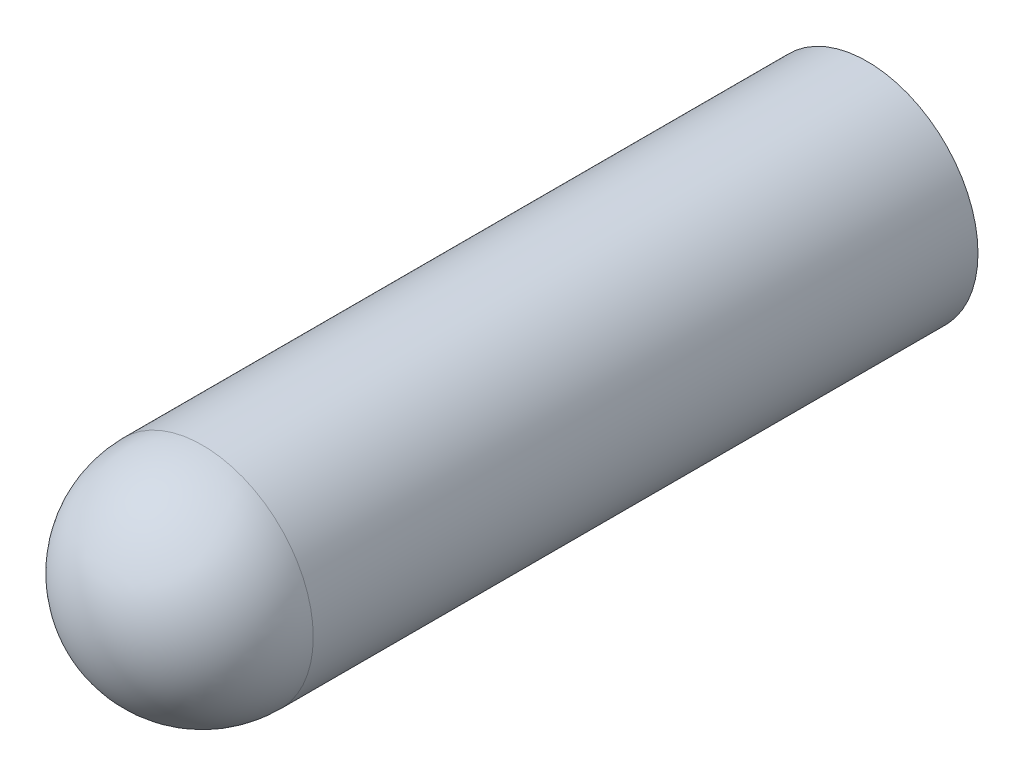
ISO-10303-21;
HEADER;
FILE_DESCRIPTION(('STEP AP214'),'2;1');
FILE_NAME('part.step','',(''),(''),'','','');
FILE_SCHEMA(('AUTOMOTIVE_DESIGN { 1 0 10303 214 1 1 1 1 }'));
ENDSEC;
DATA;
#1=APPLICATION_CONTEXT('core data for automotive mechanical design processes');
#2=APPLICATION_PROTOCOL_DEFINITION('international standard','automotive_design',2000,#1);
#3=PRODUCT_CONTEXT('',#1,'mechanical');
#4=PRODUCT('Part','Part','',(#3));
#5=PRODUCT_RELATED_PRODUCT_CATEGORY('part','',(#4));
#6=PRODUCT_DEFINITION_FORMATION('','',#4);
#7=PRODUCT_DEFINITION_CONTEXT('part definition',#1,'design');
#8=PRODUCT_DEFINITION('design','',#6,#7);
#9=PRODUCT_DEFINITION_SHAPE('','',#8);
#10=(LENGTH_UNIT() NAMED_UNIT(*) SI_UNIT(.MILLI.,.METRE.));
#11=(NAMED_UNIT(*) PLANE_ANGLE_UNIT() SI_UNIT($,.RADIAN.));
#12=(NAMED_UNIT(*) SI_UNIT($,.STERADIAN.) SOLID_ANGLE_UNIT());
#13=UNCERTAINTY_MEASURE_WITH_UNIT(LENGTH_MEASURE(1.E-05),#10,'distance_accuracy_value','');
#14=(GEOMETRIC_REPRESENTATION_CONTEXT(3) GLOBAL_UNCERTAINTY_ASSIGNED_CONTEXT((#13)) GLOBAL_UNIT_ASSIGNED_CONTEXT((#10,
#11,#12)) REPRESENTATION_CONTEXT('',''));
#15=CARTESIAN_POINT('',(0.,0.,0.));
#16=DIRECTION('',(0.,0.,1.));
#17=DIRECTION('',(1.,0.,0.));
#18=AXIS2_PLACEMENT_3D('',#15,#16,#17);
#19=CARTESIAN_POINT('',(0.,0.,38.1));
#20=DIRECTION('',(0.,0.,-1.));
#21=DIRECTION('',(-1.,0.,0.));
#22=AXIS2_PLACEMENT_3D('',#19,#20,#21);
#23=CYLINDRICAL_SURFACE('',#22,6.35);
#24=CARTESIAN_POINT('',(0.,0.,38.1));
#25=DIRECTION('',(0.,0.,1.));
#26=DIRECTION('',(1.,0.,0.));
#27=AXIS2_PLACEMENT_3D('',#24,#25,#26);
#28=CIRCLE('',#27,6.35);
#29=CARTESIAN_POINT('',(-6.35,0.,38.1));
#30=VERTEX_POINT('',#29);
#31=EDGE_CURVE('E10',#30,#30,#28,.T.);
#32=CARTESIAN_POINT('',(0.,0.,0.));
#33=DIRECTION('',(0.,0.,1.));
#34=DIRECTION('',(1.,0.,0.));
#35=AXIS2_PLACEMENT_3D('',#32,#33,#34);
#36=CIRCLE('',#35,6.35);
#37=CARTESIAN_POINT('',(-6.35,0.,0.));
#38=VERTEX_POINT('',#37);
#39=EDGE_CURVE('E36',#38,#38,#36,.T.);
#40=CARTESIAN_POINT('',(-6.35,0.,38.1));
#41=CARTESIAN_POINT('',(-6.35,0.,37.703125));
#42=CARTESIAN_POINT('',(-6.35,0.,37.30625));
#43=CARTESIAN_POINT('',(-6.35,0.,36.5125));
#44=CARTESIAN_POINT('',(-6.35,0.,36.115625));
#45=CARTESIAN_POINT('',(-6.35,0.,35.321875));
#46=CARTESIAN_POINT('',(-6.35,0.,34.925));
#47=CARTESIAN_POINT('',(-6.35,0.,34.13125));
#48=CARTESIAN_POINT('',(-6.35,0.,33.734375));
#49=CARTESIAN_POINT('',(-6.35,0.,32.940625));
#50=CARTESIAN_POINT('',(-6.35,0.,32.54375));
#51=CARTESIAN_POINT('',(-6.35,0.,31.75));
#52=CARTESIAN_POINT('',(-6.35,0.,31.353125));
#53=CARTESIAN_POINT('',(-6.35,0.,30.559375));
#54=CARTESIAN_POINT('',(-6.35,0.,30.1625));
#55=CARTESIAN_POINT('',(-6.35,0.,29.36875));
#56=CARTESIAN_POINT('',(-6.35,0.,28.971875));
#57=CARTESIAN_POINT('',(-6.35,0.,28.178125));
#58=CARTESIAN_POINT('',(-6.35,0.,27.78125));
#59=CARTESIAN_POINT('',(-6.35,0.,26.9875));
#60=CARTESIAN_POINT('',(-6.35,0.,26.590625));
#61=CARTESIAN_POINT('',(-6.35,0.,25.796875));
#62=CARTESIAN_POINT('',(-6.35,0.,25.4));
#63=CARTESIAN_POINT('',(-6.35,0.,24.60625));
#64=CARTESIAN_POINT('',(-6.35,0.,24.209375));
#65=CARTESIAN_POINT('',(-6.35,0.,23.415625));
#66=CARTESIAN_POINT('',(-6.35,0.,23.01875));
#67=CARTESIAN_POINT('',(-6.35,0.,22.225));
#68=CARTESIAN_POINT('',(-6.35,0.,21.828125));
#69=CARTESIAN_POINT('',(-6.35,0.,21.034375));
#70=CARTESIAN_POINT('',(-6.35,0.,20.6375));
#71=CARTESIAN_POINT('',(-6.35,0.,19.84375));
#72=CARTESIAN_POINT('',(-6.35,0.,19.446875));
#73=CARTESIAN_POINT('',(-6.35,0.,18.653125));
#74=CARTESIAN_POINT('',(-6.35,0.,18.25625));
#75=CARTESIAN_POINT('',(-6.35,0.,17.4625));
#76=CARTESIAN_POINT('',(-6.35,0.,17.065625));
#77=CARTESIAN_POINT('',(-6.35,0.,16.271875));
#78=CARTESIAN_POINT('',(-6.35,0.,15.875));
#79=CARTESIAN_POINT('',(-6.35,0.,15.08125));
#80=CARTESIAN_POINT('',(-6.35,0.,14.684375));
#81=CARTESIAN_POINT('',(-6.35,0.,13.890625));
#82=CARTESIAN_POINT('',(-6.35,0.,13.49375));
#83=CARTESIAN_POINT('',(-6.35,0.,12.7));
#84=CARTESIAN_POINT('',(-6.35,0.,12.303125));
#85=CARTESIAN_POINT('',(-6.35,0.,11.509375));
#86=CARTESIAN_POINT('',(-6.35,0.,11.1125));
#87=CARTESIAN_POINT('',(-6.35,0.,10.31875));
#88=CARTESIAN_POINT('',(-6.35,0.,9.921875));
#89=CARTESIAN_POINT('',(-6.35,0.,9.128125));
#90=CARTESIAN_POINT('',(-6.35,0.,8.73125));
#91=CARTESIAN_POINT('',(-6.35,0.,7.9375));
#92=CARTESIAN_POINT('',(-6.35,0.,7.540625));
#93=CARTESIAN_POINT('',(-6.35,0.,6.746875));
#94=CARTESIAN_POINT('',(-6.35,0.,6.35));
#95=CARTESIAN_POINT('',(-6.35,0.,5.55625));
#96=CARTESIAN_POINT('',(-6.35,0.,5.159375));
#97=CARTESIAN_POINT('',(-6.35,0.,4.365625));
#98=CARTESIAN_POINT('',(-6.35,0.,3.96875));
#99=CARTESIAN_POINT('',(-6.35,0.,3.175));
#100=CARTESIAN_POINT('',(-6.35,0.,2.778125));
#101=CARTESIAN_POINT('',(-6.35,0.,1.984375));
#102=CARTESIAN_POINT('',(-6.35,0.,1.5875));
#103=CARTESIAN_POINT('',(-6.35,0.,0.79375));
#104=CARTESIAN_POINT('',(-6.35,0.,0.396875));
#105=CARTESIAN_POINT('',(-6.35,0.,0.));
#106=B_SPLINE_CURVE_WITH_KNOTS('',3,(#40,#41,#42,#43,#44,#45,#46,#47,#48,#49,#50,#51,#52,#53,
#54,#55,#56,#57,#58,#59,#60,#61,#62,#63,#64,#65,#66,#67,#68,#69,#70,#71,#72,#73,#74,#75,#76,#77,
#78,#79,#80,#81,#82,#83,#84,#85,#86,#87,#88,#89,#90,#91,#92,#93,#94,#95,#96,#97,#98,#99,#100,
#101,#102,#103,#104,#105),.UNSPECIFIED.,.F.,.F.,(4,2,2,2,2,2,2,2,2,2,2,2,2,2,2,2,2,2,2,2,2,2,2,
2,2,2,2,2,2,2,2,2,4),(0.,1.19062499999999,2.38124999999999,3.571875,4.7625,5.953125,7.14375,
8.33437499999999,9.525,10.715625,11.90625,13.096875,14.2875,15.478125,16.66875,17.859375,19.05,
20.240625,21.43125,22.621875,23.8125,25.003125,26.19375,27.384375,28.575,29.765625,30.95625,
32.146875,33.3375,34.528125,35.71875,36.909375,38.1),.UNSPECIFIED.);
#107=EDGE_CURVE('BSEAM33',#30,#38,#106,.T.);
#108=ORIENTED_EDGE('',*,*,#31,.F.);
#109=ORIENTED_EDGE('',*,*,#39,.T.);
#110=ORIENTED_EDGE('',*,*,#107,.T.);
#111=ORIENTED_EDGE('',*,*,#107,.F.);
#112=EDGE_LOOP('',(#108,#110,#109,#111));
#113=FACE_BOUND('',#112,.T.);
#114=ADVANCED_FACE('F33',(#113),#23,.T.);
#115=CARTESIAN_POINT('',(0.,0.,0.));
#116=DIRECTION('',(0.,0.,1.));
#117=DIRECTION('',(1.,0.,0.));
#118=AXIS2_PLACEMENT_3D('',#115,#116,#117);
#119=PLANE('',#118);
#120=CARTESIAN_POINT('',(0.,0.,0.));
#121=DIRECTION('',(0.,0.,-1.));
#122=DIRECTION('',(-1.,0.,0.));
#123=AXIS2_PLACEMENT_3D('',#120,#121,#122);
#124=CIRCLE('',#123,1.905);
#125=CARTESIAN_POINT('',(-1.905,0.,0.));
#126=VERTEX_POINT('',#125);
#127=EDGE_CURVE('E45',#126,#126,#124,.T.);
#128=ORIENTED_EDGE('',*,*,#127,.F.);
#129=EDGE_LOOP('',(#128));
#130=FACE_BOUND('',#129,.T.);
#131=ORIENTED_EDGE('',*,*,#39,.F.);
#132=EDGE_LOOP('',(#131));
#133=FACE_BOUND('',#132,.T.);
#134=ADVANCED_FACE('F60',(#130,#133),#119,.F.);
#135=CARTESIAN_POINT('',(0.,0.,38.1));
#136=DIRECTION('',(-1.,0.,0.));
#137=DIRECTION('',(0.,-1.,0.));
#138=AXIS2_PLACEMENT_3D('',#135,#136,#137);
#139=SPHERICAL_SURFACE('',#138,6.35);
#140=CARTESIAN_POINT('',(0.,0.,38.1));
#141=DIRECTION('',(0.,0.,1.));
#142=DIRECTION('',(1.,0.,0.));
#143=AXIS2_PLACEMENT_3D('',#140,#141,#142);
#144=SPHERICAL_SURFACE('',#143,6.35);
#145=ORIENTED_EDGE('',*,*,#31,.T.);
#146=EDGE_LOOP('',(#145));
#147=FACE_BOUND('',#146,.T.);
#148=ADVANCED_FACE('F56',(#147),#144,.T.);
#149=CARTESIAN_POINT('',(0.,0.,25.4));
#150=DIRECTION('',(0.,0.,-1.));
#151=DIRECTION('',(-1.,0.,0.));
#152=AXIS2_PLACEMENT_3D('',#149,#150,#151);
#153=CYLINDRICAL_SURFACE('',#152,1.905);
#154=CARTESIAN_POINT('',(0.,0.,25.4));
#155=DIRECTION('',(0.,0.,-1.));
#156=DIRECTION('',(-1.,0.,0.));
#157=AXIS2_PLACEMENT_3D('',#154,#155,#156);
#158=CIRCLE('',#157,1.905);
#159=CARTESIAN_POINT('',(-1.905,0.,25.4));
#160=VERTEX_POINT('',#159);
#161=EDGE_CURVE('E43',#160,#160,#158,.T.);
#162=ORIENTED_EDGE('',*,*,#161,.F.);
#163=EDGE_LOOP('',(#162));
#164=FACE_BOUND('',#163,.T.);
#165=ORIENTED_EDGE('',*,*,#127,.T.);
#166=EDGE_LOOP('',(#165));
#167=FACE_BOUND('',#166,.T.);
#168=ADVANCED_FACE('F53',(#164,#167),#153,.F.);
#169=CARTESIAN_POINT('',(0.,0.,25.4));
#170=DIRECTION('',(0.,0.,-1.));
#171=DIRECTION('',(-1.,0.,0.));
#172=AXIS2_PLACEMENT_3D('',#169,#170,#171);
#173=PLANE('',#172);
#174=ORIENTED_EDGE('',*,*,#161,.T.);
#175=EDGE_LOOP('',(#174));
#176=FACE_BOUND('',#175,.T.);
#177=ADVANCED_FACE('F51',(#176),#173,.T.);
#178=CLOSED_SHELL('',(#114,#134,#148,#168,#177));
#179=MANIFOLD_SOLID_BREP('B2',#178);
#180=ADVANCED_BREP_SHAPE_REPRESENTATION('',(#18,#179),#14);
#181=SHAPE_DEFINITION_REPRESENTATION(#9,#180);
ENDSEC;
END-ISO-10303-21;
